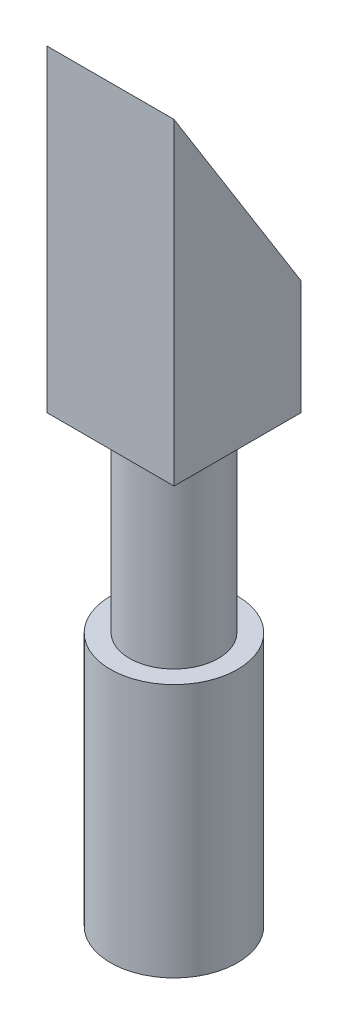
from build123d import *

# Parameters (mm, degrees)
SKETCH1_W               = 12.7
SKETCH1_H               = 12.7
BOSS_EXTRUDE1_DEPTH     = 31.75
CUT_EXTRUDE1_DEPTH      = 35.781234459
CUT_EXTRUDE1_DEPTH_BACK = 35.781234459
SKETCH3_R               = 4.445
BOSS_EXTRUDE2_DEPTH     = 19.05
SKETCH4_R               = 6.35
BOSS_EXTRUDE4_DEPTH     = 25.4


with BuildPart() as part:
    # Sketch1 → Boss-Extrude1 (new body)
    with BuildSketch(Plane(origin=(0, 0, 0), x_dir=(1, 0, 0), z_dir=(0, 1, 0))):
        with Locations((0.843960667, -0.004665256)):
            Rectangle(SKETCH1_W, SKETCH1_H)
    extrude(amount=BOSS_EXTRUDE1_DEPTH)

    # Sketch2 → Cut-Extrude1 (cut, two sides: drawn at the far end of the back side and taken through both)
    with BuildSketch(Plane(origin=(7.193960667, 0, 0), x_dir=(0, 0, -1), z_dir=(1, 0, 0)).offset(-CUT_EXTRUDE1_DEPTH_BACK)):
        Polygon((-47.902126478, 98.225937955), (-6.354665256, 31.75), (6.345334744, 11.43), (47.892795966, -55.045937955), (180.844671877, 28.048984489), (85.049749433, 181.320860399), align=None)
    extrude(amount=CUT_EXTRUDE1_DEPTH + CUT_EXTRUDE1_DEPTH_BACK, mode=Mode.SUBTRACT)

    # Sketch3 → Boss-Extrude2 (add)
    with BuildSketch(Plane.XZ):
        with Locations(Location((0.843960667, 0.004665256, 0), (0, 0, 90))):
            Circle(SKETCH3_R)
    extrude(amount=BOSS_EXTRUDE2_DEPTH)

    # Sketch4 → Boss-Extrude4 (add)
    with BuildSketch(Plane.XZ.offset(19.05)):
        with Locations(Location((0.843960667, 0.004665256, 0), (0, 0, 270))):
            Circle(SKETCH4_R)
    extrude(amount=BOSS_EXTRUDE4_DEPTH)


solid = part.part
